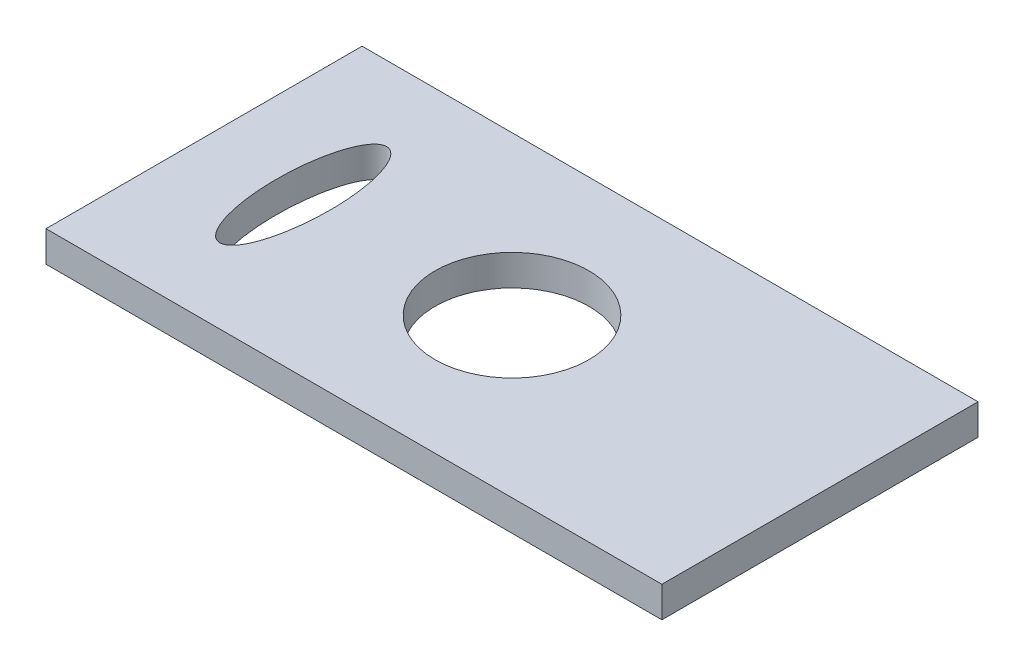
from build123d import *

# Parameters (mm, degrees)
SKETCH1_W           = 200
SKETCH1_H           = 102.651515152
SKETCH1_R           = 25
SKETCH1_RX          = 27.083333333
SKETCH1_RY          = 8.712121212
BOSS_EXTRUDE1_DEPTH = 10


with BuildPart() as part:
    # Sketch1 → Boss-Extrude1 (new body)
    with BuildSketch(Plane(origin=(0, 0, 0), x_dir=(1, 0, 0), z_dir=(0, 1, 0))):
        Rectangle(SKETCH1_W, SKETCH1_H)
        with Locations(Location((0, 0, 0), (0, 0, 270))):
            Circle(SKETCH1_R, mode=Mode.SUBTRACT)
        with Locations(Location((-67.803030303, 0), (0, 0, -90))):
            Ellipse(SKETCH1_RX, SKETCH1_RY, mode=Mode.SUBTRACT)
    extrude(amount=BOSS_EXTRUDE1_DEPTH)


solid = part.part
